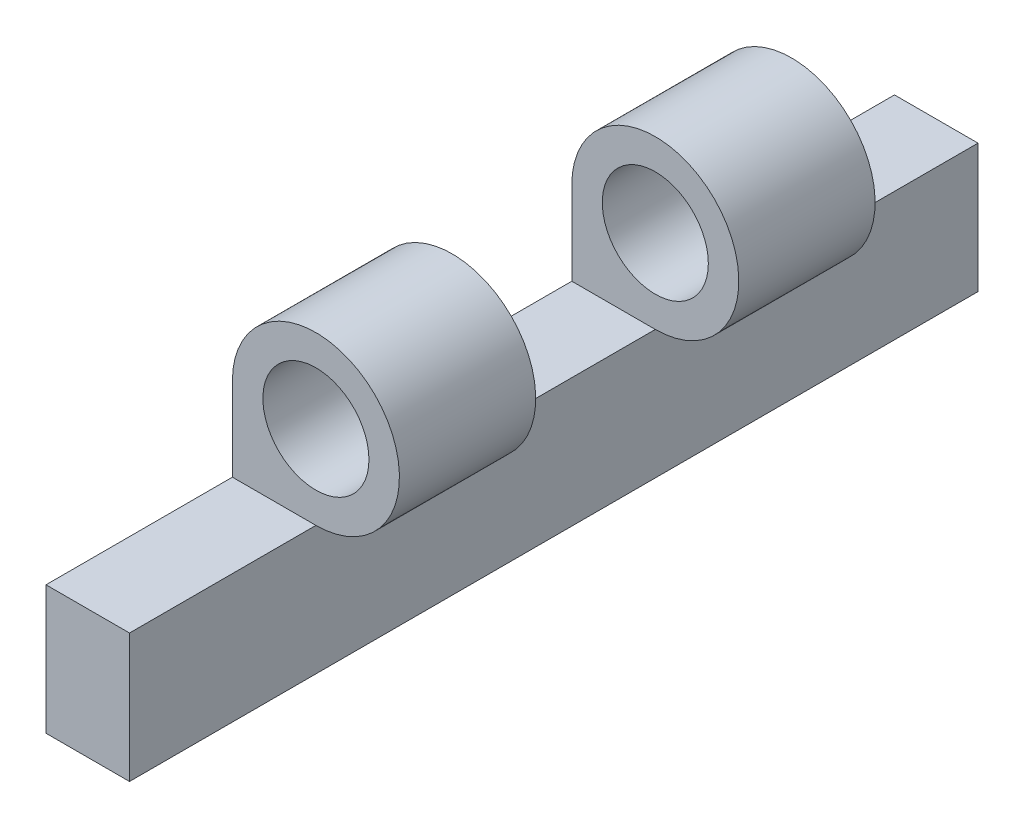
from build123d import *

# Parameters (mm, degrees)
SKETCH1_W           = 5
SKETCH1_H           = 12.7
EXTRUDE_THIN1_DEPTH = 25.4
SKETCH2_R           = 5
SKETCH3_R           = 3.175
CUT_EXTRUDE1_DEPTH  = 55.716816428
F_3CUTS_DEPTH       = 32.360006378
F_3CUTS_DEPTH_BACK  = 32.360006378
SKETCH7_W           = 11.16
SKETCH7_H           = 10
SKETCH7_W_2         = 12.16


with BuildPart() as part:
    # Sketch1 → Extrude-Thin1 (new, symmetric)
    with BuildSketch(Plane.XY):
        with Locations((2.5, 6.35)):
            Rectangle(SKETCH1_W, SKETCH1_H)
    extrude(amount=EXTRUDE_THIN1_DEPTH, both=True)

    # Sweep1: sweep along a curve in space
    with BuildLine() as sweep1_path:
        Line((0, 12.7, 25.4), (0, 12.7, -25.4))
    # Sketch2 → Sweep1 (sweep)
    with BuildSketch(Plane.XY.offset(25.4)):
        with Locations((5, 12.7)):
            Circle(SKETCH2_R)
    sweep(path=sweep1_path.line)

    # Sketch3 → Cut-Extrude1 (cut, through all)
    with BuildSketch(Plane.XY.offset(25.4)):
        with Locations((5, 12.7)):
            Circle(SKETCH3_R)
    extrude(amount=-CUT_EXTRUDE1_DEPTH, mode=Mode.SUBTRACT)

    # Sketch7 → 3Cuts (cut, two sides: drawn at the far end of the back side and taken through both)
    with BuildSketch(Plane(origin=(5, 0, 0), x_dir=(0, 0, -1), z_dir=(1, 0, 0)).offset(-F_3CUTS_DEPTH_BACK)):
        with Locations((-19.82, 12.7)):
            Rectangle(SKETCH7_W, SKETCH7_H)
        with Locations((0, 12.7)):
            Rectangle(SKETCH7_W_2, SKETCH7_H)
        with Locations((19.82, 12.7)):
            Rectangle(SKETCH7_W, SKETCH7_H)
    extrude(amount=F_3CUTS_DEPTH + F_3CUTS_DEPTH_BACK, mode=Mode.SUBTRACT)


solid = part.part
